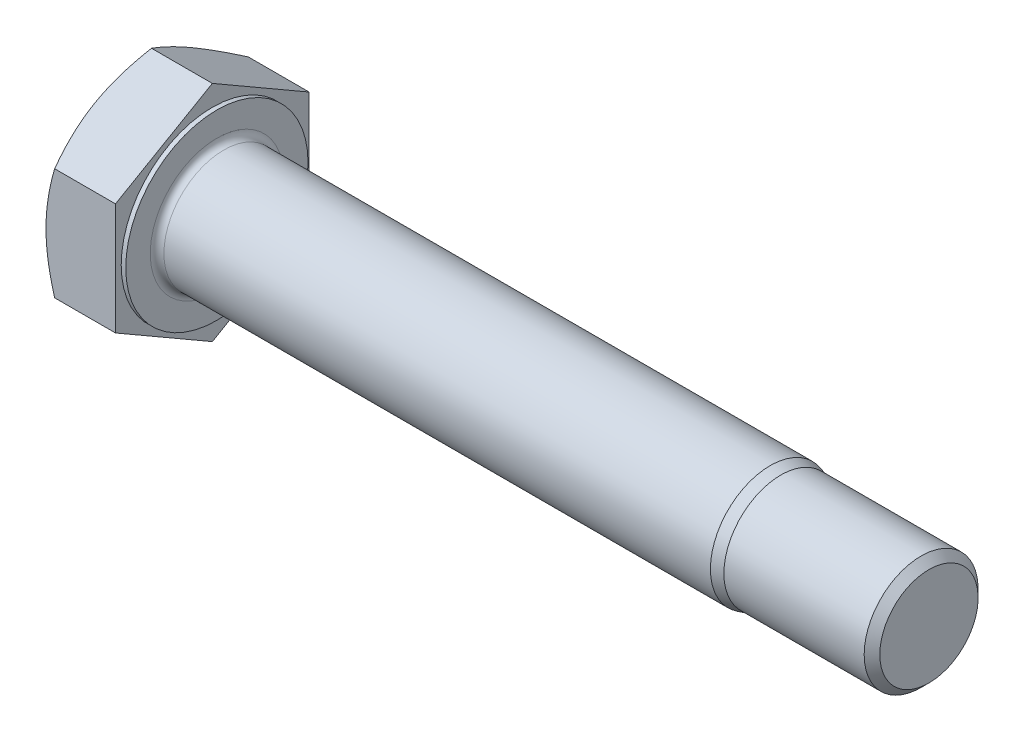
ISO-10303-21;
HEADER;
FILE_DESCRIPTION(('STEP AP214'),'2;1');
FILE_NAME('part.step','',(''),(''),'','','');
FILE_SCHEMA(('AUTOMOTIVE_DESIGN { 1 0 10303 214 1 1 1 1 }'));
ENDSEC;
DATA;
#1=APPLICATION_CONTEXT('core data for automotive mechanical design processes');
#2=APPLICATION_PROTOCOL_DEFINITION('international standard','automotive_design',2000,#1);
#3=PRODUCT_CONTEXT('',#1,'mechanical');
#4=PRODUCT('Part','Part','',(#3));
#5=PRODUCT_RELATED_PRODUCT_CATEGORY('part','',(#4));
#6=PRODUCT_DEFINITION_FORMATION('','',#4);
#7=PRODUCT_DEFINITION_CONTEXT('part definition',#1,'design');
#8=PRODUCT_DEFINITION('design','',#6,#7);
#9=PRODUCT_DEFINITION_SHAPE('','',#8);
#10=(LENGTH_UNIT() NAMED_UNIT(*) SI_UNIT(.MILLI.,.METRE.));
#11=(NAMED_UNIT(*) PLANE_ANGLE_UNIT() SI_UNIT($,.RADIAN.));
#12=(NAMED_UNIT(*) SI_UNIT($,.STERADIAN.) SOLID_ANGLE_UNIT());
#13=UNCERTAINTY_MEASURE_WITH_UNIT(LENGTH_MEASURE(1.E-05),#10,'distance_accuracy_value','');
#14=(GEOMETRIC_REPRESENTATION_CONTEXT(3) GLOBAL_UNCERTAINTY_ASSIGNED_CONTEXT((#13)) GLOBAL_UNIT_ASSIGNED_CONTEXT((#10,
#11,#12)) REPRESENTATION_CONTEXT('',''));
#15=CARTESIAN_POINT('',(0.,0.,0.));
#16=DIRECTION('',(0.,0.,1.));
#17=DIRECTION('',(1.,0.,0.));
#18=AXIS2_PLACEMENT_3D('',#15,#16,#17);
#19=CARTESIAN_POINT('',(13.,19.6299091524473,0.));
#20=DIRECTION('',(1.,0.,0.));
#21=DIRECTION('',(0.,0.,-1.));
#22=AXIS2_PLACEMENT_3D('',#19,#20,#21);
#23=PLANE('',#22);
#24=CARTESIAN_POINT('',(13.,0.,0.));
#25=DIRECTION('',(1.,0.,0.));
#26=DIRECTION('',(0.,0.,-1.));
#27=AXIS2_PLACEMENT_3D('',#24,#25,#26);
#28=CIRCLE('',#27,11.7);
#29=CARTESIAN_POINT('',(13.,0.,-11.7));
#30=VERTEX_POINT('',#29);
#31=EDGE_CURVE('E40',#30,#30,#28,.F.);
#32=ORIENTED_EDGE('',*,*,#31,.T.);
#33=EDGE_LOOP('',(#32));
#34=FACE_BOUND('',#33,.T.);
#35=CARTESIAN_POINT('',(13.,0.,0.));
#36=DIRECTION('',(-1.,0.,0.));
#37=DIRECTION('',(0.,0.,1.));
#38=AXIS2_PLACEMENT_3D('',#35,#36,#37);
#39=CIRCLE('',#38,16.);
#40=CARTESIAN_POINT('',(13.,0.,16.));
#41=VERTEX_POINT('',#40);
#42=EDGE_CURVE('E430',#41,#41,#39,.T.);
#43=ORIENTED_EDGE('',*,*,#42,.F.);
#44=EDGE_LOOP('',(#43));
#45=FACE_BOUND('',#44,.T.);
#46=ADVANCED_FACE('F32',(#34,#45),#23,.T.);
#47=CARTESIAN_POINT('',(138.,0.,0.));
#48=DIRECTION('',(-1.,0.,0.));
#49=DIRECTION('',(0.,0.,1.));
#50=AXIS2_PLACEMENT_3D('',#47,#48,#49);
#51=PLANE('',#50);
#52=CARTESIAN_POINT('',(138.,0.,0.));
#53=DIRECTION('',(-1.,0.,0.));
#54=DIRECTION('',(0.,0.,1.));
#55=AXIS2_PLACEMENT_3D('',#52,#53,#54);
#56=CIRCLE('',#55,8.626);
#57=CARTESIAN_POINT('',(138.,0.,8.626));
#58=VERTEX_POINT('',#57);
#59=EDGE_CURVE('E378',#58,#58,#56,.T.);
#60=ORIENTED_EDGE('',*,*,#59,.F.);
#61=EDGE_LOOP('',(#60));
#62=FACE_BOUND('',#61,.T.);
#63=ADVANCED_FACE('F155',(#62),#51,.F.);
#64=CARTESIAN_POINT('',(138.,0.,0.));
#65=DIRECTION('',(-1.,0.,0.));
#66=DIRECTION('',(0.,0.,1.));
#67=AXIS2_PLACEMENT_3D('',#64,#65,#66);
#68=CONICAL_SURFACE('',#67,8.626,0.785398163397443);
#69=CARTESIAN_POINT('',(136.626,0.,0.));
#70=DIRECTION('',(-1.,0.,0.));
#71=DIRECTION('',(0.,0.,1.));
#72=AXIS2_PLACEMENT_3D('',#69,#70,#71);
#73=CIRCLE('',#72,10.);
#74=CARTESIAN_POINT('',(136.626,0.,10.));
#75=VERTEX_POINT('',#74);
#76=EDGE_CURVE('E375',#75,#75,#73,.T.);
#77=ORIENTED_EDGE('',*,*,#76,.F.);
#78=EDGE_LOOP('',(#77));
#79=FACE_BOUND('',#78,.T.);
#80=ORIENTED_EDGE('',*,*,#59,.T.);
#81=EDGE_LOOP('',(#80));
#82=FACE_BOUND('',#81,.T.);
#83=ADVANCED_FACE('F160',(#79,#82),#68,.T.);
#84=CARTESIAN_POINT('',(0.,0.,0.));
#85=DIRECTION('',(-1.,0.,0.));
#86=DIRECTION('',(0.,0.,1.));
#87=AXIS2_PLACEMENT_3D('',#84,#85,#86);
#88=CYLINDRICAL_SURFACE('',#87,10.);
#89=CARTESIAN_POINT('',(112.,0.,0.));
#90=DIRECTION('',(-1.,0.,0.));
#91=DIRECTION('',(0.,0.,1.));
#92=AXIS2_PLACEMENT_3D('',#89,#90,#91);
#93=CIRCLE('',#92,10.);
#94=CARTESIAN_POINT('',(112.,0.,10.));
#95=VERTEX_POINT('',#94);
#96=EDGE_CURVE('E383',#95,#95,#93,.T.);
#97=ORIENTED_EDGE('',*,*,#96,.F.);
#98=EDGE_LOOP('',(#97));
#99=FACE_BOUND('',#98,.T.);
#100=ORIENTED_EDGE('',*,*,#76,.T.);
#101=EDGE_LOOP('',(#100));
#102=FACE_BOUND('',#101,.T.);
#103=ADVANCED_FACE('F345',(#99,#102),#88,.T.);
#104=CARTESIAN_POINT('',(112.,0.,0.));
#105=DIRECTION('',(-1.,0.,0.));
#106=DIRECTION('',(0.,0.,1.));
#107=AXIS2_PLACEMENT_3D('',#104,#105,#106);
#108=CONICAL_SURFACE('',#107,10.,0.261799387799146);
#109=CARTESIAN_POINT('',(110.133974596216,0.,0.));
#110=DIRECTION('',(-1.,0.,0.));
#111=DIRECTION('',(0.,0.,1.));
#112=AXIS2_PLACEMENT_3D('',#109,#110,#111);
#113=CIRCLE('',#112,10.5);
#114=CARTESIAN_POINT('',(110.133974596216,0.,10.5));
#115=VERTEX_POINT('',#114);
#116=EDGE_CURVE('E405',#115,#115,#113,.T.);
#117=ORIENTED_EDGE('',*,*,#116,.F.);
#118=EDGE_LOOP('',(#117));
#119=FACE_BOUND('',#118,.T.);
#120=ORIENTED_EDGE('',*,*,#96,.T.);
#121=EDGE_LOOP('',(#120));
#122=FACE_BOUND('',#121,.T.);
#123=ADVANCED_FACE('F262',(#119,#122),#108,.T.);
#124=CARTESIAN_POINT('',(0.,0.,0.));
#125=DIRECTION('',(-1.,0.,0.));
#126=DIRECTION('',(0.,0.,1.));
#127=AXIS2_PLACEMENT_3D('',#124,#125,#126);
#128=CYLINDRICAL_SURFACE('',#127,10.5);
#129=CARTESIAN_POINT('',(14.2,0.,0.));
#130=DIRECTION('',(1.,0.,0.));
#131=DIRECTION('',(0.,0.,-1.));
#132=AXIS2_PLACEMENT_3D('',#129,#130,#131);
#133=CIRCLE('',#132,10.5);
#134=CARTESIAN_POINT('',(14.2,0.,-10.5));
#135=VERTEX_POINT('',#134);
#136=EDGE_CURVE('E11',#135,#135,#133,.T.);
#137=ORIENTED_EDGE('',*,*,#136,.T.);
#138=EDGE_LOOP('',(#137));
#139=FACE_BOUND('',#138,.T.);
#140=ORIENTED_EDGE('',*,*,#116,.T.);
#141=EDGE_LOOP('',(#140));
#142=FACE_BOUND('',#141,.T.);
#143=ADVANCED_FACE('F201',(#139,#142),#128,.T.);
#144=CARTESIAN_POINT('',(12.2,16.,0.));
#145=DIRECTION('',(1.,0.,0.));
#146=DIRECTION('',(0.,0.,-1.));
#147=AXIS2_PLACEMENT_3D('',#144,#145,#146);
#148=PLANE('',#147);
#149=CARTESIAN_POINT('',(12.2,0.,0.));
#150=DIRECTION('',(-1.,0.,0.));
#151=DIRECTION('',(0.,0.,1.));
#152=AXIS2_PLACEMENT_3D('',#149,#150,#151);
#153=CIRCLE('',#152,16.);
#154=CARTESIAN_POINT('',(12.2,0.,16.));
#155=VERTEX_POINT('',#154);
#156=EDGE_CURVE('E425',#155,#155,#153,.T.);
#157=ORIENTED_EDGE('',*,*,#156,.T.);
#158=EDGE_LOOP('',(#157));
#159=FACE_BOUND('',#158,.T.);
#160=DIRECTION('',(0.,0.500000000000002,0.866025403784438));
#161=VECTOR('',#160,1.);
#162=CARTESIAN_POINT('',(12.2,9.81495457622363,-17.));
#163=LINE('',#162,#161);
#164=CARTESIAN_POINT('',(12.2,9.81495457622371,-17.));
#165=VERTEX_POINT('',#164);
#166=CARTESIAN_POINT('',(12.2,19.6299091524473,0.));
#167=VERTEX_POINT('',#166);
#168=EDGE_CURVE('E109',#165,#167,#163,.T.);
#169=ORIENTED_EDGE('',*,*,#168,.T.);
#170=DIRECTION('',(0.,-0.500000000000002,0.866025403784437));
#171=VECTOR('',#170,1.);
#172=CARTESIAN_POINT('',(12.2,19.6299091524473,0.));
#173=LINE('',#172,#171);
#174=CARTESIAN_POINT('',(12.2,9.81495457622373,17.));
#175=VERTEX_POINT('',#174);
#176=EDGE_CURVE('E103',#167,#175,#173,.T.);
#177=ORIENTED_EDGE('',*,*,#176,.T.);
#178=DIRECTION('',(0.,-1.,0.));
#179=VECTOR('',#178,1.);
#180=CARTESIAN_POINT('',(12.2,9.81495457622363,17.));
#181=LINE('',#180,#179);
#182=CARTESIAN_POINT('',(12.2,-9.81495457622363,17.0000000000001));
#183=VERTEX_POINT('',#182);
#184=EDGE_CURVE('E106',#175,#183,#181,.T.);
#185=ORIENTED_EDGE('',*,*,#184,.T.);
#186=DIRECTION('',(0.,-0.500000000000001,-0.866025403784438));
#187=VECTOR('',#186,1.);
#188=CARTESIAN_POINT('',(12.2,-19.6299091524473,0.));
#189=LINE('',#188,#187);
#190=CARTESIAN_POINT('',(12.2,-19.6299091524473,0.));
#191=VERTEX_POINT('',#190);
#192=EDGE_CURVE('E122',#183,#191,#189,.T.);
#193=ORIENTED_EDGE('',*,*,#192,.T.);
#194=DIRECTION('',(0.,0.5,-0.866025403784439));
#195=VECTOR('',#194,1.);
#196=CARTESIAN_POINT('',(12.2,-9.81495457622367,-17.));
#197=LINE('',#196,#195);
#198=CARTESIAN_POINT('',(12.2,-9.81495457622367,-17.));
#199=VERTEX_POINT('',#198);
#200=EDGE_CURVE('E47',#191,#199,#197,.T.);
#201=ORIENTED_EDGE('',*,*,#200,.T.);
#202=DIRECTION('',(0.,1.,0.));
#203=VECTOR('',#202,1.);
#204=CARTESIAN_POINT('',(12.2,9.81495457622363,-17.));
#205=LINE('',#204,#203);
#206=EDGE_CURVE('E140',#199,#165,#205,.T.);
#207=ORIENTED_EDGE('',*,*,#206,.T.);
#208=EDGE_LOOP('',(#169,#177,#185,#193,#201,#207));
#209=FACE_BOUND('',#208,.T.);
#210=ADVANCED_FACE('F105',(#159,#209),#148,.T.);
#211=CARTESIAN_POINT('',(0.,0.,0.));
#212=DIRECTION('',(-1.,0.,0.));
#213=DIRECTION('',(0.,0.,1.));
#214=AXIS2_PLACEMENT_3D('',#211,#212,#213);
#215=CYLINDRICAL_SURFACE('',#214,16.);
#216=ORIENTED_EDGE('',*,*,#42,.T.);
#217=EDGE_LOOP('',(#216));
#218=FACE_BOUND('',#217,.T.);
#219=ORIENTED_EDGE('',*,*,#156,.F.);
#220=EDGE_LOOP('',(#219));
#221=FACE_BOUND('',#220,.T.);
#222=ADVANCED_FACE('F169',(#218,#221),#215,.T.);
#223=CARTESIAN_POINT('',(0.,19.6299091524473,0.));
#224=DIRECTION('',(1.,0.,0.));
#225=DIRECTION('',(0.,0.,-1.));
#226=AXIS2_PLACEMENT_3D('',#223,#224,#225);
#227=PLANE('',#226);
#228=CARTESIAN_POINT('',(0.,0.,0.));
#229=DIRECTION('',(1.,0.,0.));
#230=DIRECTION('',(0.,0.,-1.));
#231=AXIS2_PLACEMENT_3D('',#228,#229,#230);
#232=CIRCLE('',#231,17.);
#233=CARTESIAN_POINT('',(0.,0.,-17.));
#234=VERTEX_POINT('',#233);
#235=CARTESIAN_POINT('',(0.,14.7224318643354,-8.50000000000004));
#236=VERTEX_POINT('',#235);
#237=EDGE_CURVE('E139',#234,#236,#232,.T.);
#238=ORIENTED_EDGE('',*,*,#237,.F.);
#239=CARTESIAN_POINT('',(0.,-14.7224318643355,-8.50000000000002));
#240=VERTEX_POINT('',#239);
#241=EDGE_CURVE('E130',#240,#234,#232,.T.);
#242=ORIENTED_EDGE('',*,*,#241,.F.);
#243=CARTESIAN_POINT('',(0.,-14.7224318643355,8.50000000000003));
#244=VERTEX_POINT('',#243);
#245=EDGE_CURVE('E138',#244,#240,#232,.T.);
#246=ORIENTED_EDGE('',*,*,#245,.F.);
#247=CARTESIAN_POINT('',(0.,0.,17.));
#248=VERTEX_POINT('',#247);
#249=EDGE_CURVE('E403',#248,#244,#232,.T.);
#250=ORIENTED_EDGE('',*,*,#249,.F.);
#251=CARTESIAN_POINT('',(0.,14.7224318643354,8.50000000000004));
#252=VERTEX_POINT('',#251);
#253=EDGE_CURVE('E416',#252,#248,#232,.T.);
#254=ORIENTED_EDGE('',*,*,#253,.F.);
#255=EDGE_CURVE('E415',#236,#252,#232,.T.);
#256=ORIENTED_EDGE('',*,*,#255,.F.);
#257=EDGE_LOOP('',(#238,#242,#246,#250,#254,#256));
#258=FACE_BOUND('',#257,.T.);
#259=ADVANCED_FACE('F165',(#258),#227,.F.);
#260=CARTESIAN_POINT('',(-4.25000000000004,0.,0.));
#261=DIRECTION('',(1.,0.,0.));
#262=DIRECTION('',(0.,0.,-1.));
#263=AXIS2_PLACEMENT_3D('',#260,#261,#262);
#264=CONICAL_SURFACE('',#263,9.63878406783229,1.04719755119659);
#265=CARTESIAN_POINT('',(1.51844542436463,19.6300246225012,0.000200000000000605));
#266=CARTESIAN_POINT('',(1.39390284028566,19.4142959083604,-0.373453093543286));
#267=CARTESIAN_POINT('',(1.27501178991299,19.197725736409,-0.748563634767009));
#268=CARTESIAN_POINT('',(1.05010368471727,18.7628487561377,-1.50179265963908));
#269=CARTESIAN_POINT('',(0.944090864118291,18.5445414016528,-1.87991208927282));
#270=CARTESIAN_POINT('',(0.74636424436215,18.1057681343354,-2.63988968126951));
#271=CARTESIAN_POINT('',(0.654684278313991,17.8852983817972,-3.02175449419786));
#272=CARTESIAN_POINT('',(0.48759203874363,17.4428269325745,-3.78813752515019));
#273=CARTESIAN_POINT('',(0.412178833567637,17.2208253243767,-4.17265558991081));
#274=CARTESIAN_POINT('',(0.280827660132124,16.7809786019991,-4.9344924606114));
#275=CARTESIAN_POINT('',(0.224454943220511,16.5631661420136,-5.31175470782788));
#276=CARTESIAN_POINT('',(0.12993050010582,16.1265431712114,-6.06800787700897));
#277=CARTESIAN_POINT('',(0.0917791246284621,15.9077326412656,-6.44699883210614));
#278=CARTESIAN_POINT('',(0.0346606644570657,15.4697440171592,-7.20561738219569));
#279=CARTESIAN_POINT('',(0.0156707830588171,15.2505666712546,-7.58524368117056));
#280=CARTESIAN_POINT('',(-0.00271629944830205,14.8120096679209,-8.34484669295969));
#281=CARTESIAN_POINT('',(-0.00211410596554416,14.5926300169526,-8.72482339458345));
#282=CARTESIAN_POINT('',(0.0173147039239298,14.1824942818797,-9.4351993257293));
#283=CARTESIAN_POINT('',(0.0337721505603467,13.9917089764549,-9.76564916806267));
#284=CARTESIAN_POINT('',(0.0811925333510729,13.6105934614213,-10.4257606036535));
#285=CARTESIAN_POINT('',(0.112155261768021,13.4202632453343,-10.7554222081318));
#286=CARTESIAN_POINT('',(0.188048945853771,13.0401300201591,-11.4138322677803));
#287=CARTESIAN_POINT('',(0.232992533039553,12.8503276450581,-11.7425796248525));
#288=CARTESIAN_POINT('',(0.336054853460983,12.4716264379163,-12.3985093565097));
#289=CARTESIAN_POINT('',(0.39417353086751,12.2827276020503,-12.7256917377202));
#290=CARTESIAN_POINT('',(0.589770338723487,11.709300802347,-13.718896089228));
#291=CARTESIAN_POINT('',(0.746752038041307,11.3264334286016,-14.3820418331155));
#292=CARTESIAN_POINT('',(1.10303610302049,10.5664076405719,-15.6984451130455));
#293=CARTESIAN_POINT('',(1.30225479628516,10.189239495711,-16.351719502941));
#294=CARTESIAN_POINT('',(1.5184454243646,9.81483910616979,-17.0002));
#295=B_SPLINE_CURVE_WITH_KNOTS('',3,(#265,#266,#267,#268,#269,#270,#271,#272,#273,#274,#275,
#276,#277,#278,#279,#280,#281,#282,#283,#284,#285,#286,#287,#288,#289,#290,#291,#292,#293,#294),
.UNSPECIFIED.,.F.,.F.,(4,2,2,2,2,2,2,2,2,2,2,2,2,2,4),(0.,1.34725361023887,2.69494899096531,
4.04577911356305,5.39653184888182,6.71394507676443,8.03138366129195,9.34725301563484,
10.6630817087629,11.8085815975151,12.9540650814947,14.1005865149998,15.2471030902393,
17.590639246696,19.9295754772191),.UNSPECIFIED.);
#296=CARTESIAN_POINT('',(1.51837875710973,19.6299091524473,0.));
#297=VERTEX_POINT('',#296);
#298=EDGE_CURVE('E55',#297,#236,#295,.T.);
#299=ORIENTED_EDGE('',*,*,#298,.T.);
#300=ORIENTED_EDGE('',*,*,#255,.T.);
#301=CARTESIAN_POINT('',(1.5184454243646,9.81483910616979,17.0002));
#302=CARTESIAN_POINT('',(1.39390284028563,10.0305678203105,16.6265469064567));
#303=CARTESIAN_POINT('',(1.27501178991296,10.2471379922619,16.251436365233));
#304=CARTESIAN_POINT('',(1.05010368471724,10.6820149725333,15.4982073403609));
#305=CARTESIAN_POINT('',(0.944090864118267,10.9003223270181,15.1200879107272));
#306=CARTESIAN_POINT('',(0.746364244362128,11.3390955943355,14.3601103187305));
#307=CARTESIAN_POINT('',(0.65468427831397,11.5595653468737,13.9782455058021));
#308=CARTESIAN_POINT('',(0.487592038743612,12.0020367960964,13.2118624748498));
#309=CARTESIAN_POINT('',(0.412178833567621,12.2240384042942,12.8273444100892));
#310=CARTESIAN_POINT('',(0.280827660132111,12.6638851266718,12.0655075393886));
#311=CARTESIAN_POINT('',(0.2244549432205,12.8816975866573,11.6882452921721));
#312=CARTESIAN_POINT('',(0.129930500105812,13.3183205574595,10.931992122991));
#313=CARTESIAN_POINT('',(0.0917791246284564,13.5371310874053,10.5530011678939));
#314=CARTESIAN_POINT('',(0.0346606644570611,13.9751197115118,9.79438261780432));
#315=CARTESIAN_POINT('',(0.0156707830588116,14.1942970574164,9.41475631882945));
#316=CARTESIAN_POINT('',(-0.00271629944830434,14.6328540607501,8.65515330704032));
#317=CARTESIAN_POINT('',(-0.00211410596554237,14.8522337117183,8.27517660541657));
#318=CARTESIAN_POINT('',(0.0173147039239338,15.2623694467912,7.56480067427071));
#319=CARTESIAN_POINT('',(0.0337721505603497,15.4531547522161,7.23435083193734));
#320=CARTESIAN_POINT('',(0.0811925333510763,15.8342702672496,6.57423939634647));
#321=CARTESIAN_POINT('',(0.112155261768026,16.0246004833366,6.24457779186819));
#322=CARTESIAN_POINT('',(0.188048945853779,16.4047337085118,5.58616773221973));
#323=CARTESIAN_POINT('',(0.232992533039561,16.5945360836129,5.25742037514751));
#324=CARTESIAN_POINT('',(0.336054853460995,16.9732372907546,4.60149064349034));
#325=CARTESIAN_POINT('',(0.394173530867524,17.1621361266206,4.27430826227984));
#326=CARTESIAN_POINT('',(0.589770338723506,17.735562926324,3.28110391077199));
#327=CARTESIAN_POINT('',(0.746752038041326,18.1184303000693,2.61795816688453));
#328=CARTESIAN_POINT('',(1.10303610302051,18.8784560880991,1.30155488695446));
#329=CARTESIAN_POINT('',(1.30225479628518,19.2556242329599,0.648280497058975));
#330=CARTESIAN_POINT('',(1.51844542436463,19.6300246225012,-0.000200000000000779));
#331=B_SPLINE_CURVE_WITH_KNOTS('',3,(#301,#302,#303,#304,#305,#306,#307,#308,#309,#310,#311,
#312,#313,#314,#315,#316,#317,#318,#319,#320,#321,#322,#323,#324,#325,#326,#327,#328,#329,#330),
.UNSPECIFIED.,.F.,.F.,(4,2,2,2,2,2,2,2,2,2,2,2,2,2,4),(0.,1.34725361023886,2.69494899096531,
4.04577911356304,5.39653184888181,6.71394507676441,8.03138366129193,9.34725301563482,
10.6630817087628,11.808581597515,12.9540650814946,14.1005865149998,15.2471030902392,
17.590639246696,19.9295754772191),.UNSPECIFIED.);
#332=EDGE_CURVE('E404',#252,#297,#331,.T.);
#333=ORIENTED_EDGE('',*,*,#332,.T.);
#334=EDGE_LOOP('',(#299,#300,#333));
#335=FACE_BOUND('',#334,.T.);
#336=ADVANCED_FACE('F168',(#335),#264,.T.);
#337=CARTESIAN_POINT('',(1.5183787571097,9.81495457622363,17.));
#338=VERTEX_POINT('',#337);
#339=EDGE_CURVE('E127',#338,#252,#331,.T.);
#340=ORIENTED_EDGE('',*,*,#339,.T.);
#341=ORIENTED_EDGE('',*,*,#253,.T.);
#342=CARTESIAN_POINT('',(8.31942681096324,-26.4115006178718,17.));
#343=CARTESIAN_POINT('',(8.13911017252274,-26.0400720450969,17.));
#344=CARTESIAN_POINT('',(7.95968911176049,-25.6682089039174,17.));
#345=CARTESIAN_POINT('',(7.60284087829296,-24.9235228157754,17.));
#346=CARTESIAN_POINT('',(7.42541372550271,-24.5506998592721,17.));
#347=CARTESIAN_POINT('',(6.8963807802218,-23.4305566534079,17.));
#348=CARTESIAN_POINT('',(6.54807662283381,-22.6816711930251,17.));
#349=CARTESIAN_POINT('',(5.86050460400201,-21.1748517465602,17.));
#350=CARTESIAN_POINT('',(5.52129585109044,-20.4168907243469,17.));
#351=CARTESIAN_POINT('',(4.85669075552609,-18.8949576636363,17.));
#352=CARTESIAN_POINT('',(4.53129376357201,-18.1309859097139,17.));
#353=CARTESIAN_POINT('',(3.88770296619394,-16.570940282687,17.));
#354=CARTESIAN_POINT('',(3.57008382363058,-15.7746280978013,17.));
#355=CARTESIAN_POINT('',(2.95876852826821,-14.1726991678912,17.));
#356=CARTESIAN_POINT('',(2.66507505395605,-13.3670813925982,17.));
#357=CARTESIAN_POINT('',(2.10929110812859,-11.7467785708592,17.));
#358=CARTESIAN_POINT('',(1.84713706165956,-10.9321155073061,17.));
#359=CARTESIAN_POINT('',(1.36279802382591,-9.29102605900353,17.));
#360=CARTESIAN_POINT('',(1.1406004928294,-8.46460345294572,17.));
#361=CARTESIAN_POINT('',(0.84589902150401,-7.2182986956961,17.));
#362=CARTESIAN_POINT('',(0.754297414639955,-6.80290529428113,17.));
#363=CARTESIAN_POINT('',(0.585044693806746,-5.96927131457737,17.));
#364=CARTESIAN_POINT('',(0.507393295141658,-5.55103079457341,17.));
#365=CARTESIAN_POINT('',(0.367410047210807,-4.71199525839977,17.));
#366=CARTESIAN_POINT('',(0.305077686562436,-4.29120032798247,17.));
#367=CARTESIAN_POINT('',(0.196970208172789,-3.44747421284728,17.));
#368=CARTESIAN_POINT('',(0.151195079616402,-3.02454302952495,17.));
#369=CARTESIAN_POINT('',(0.0776920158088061,-2.18270155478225,17.));
#370=CARTESIAN_POINT('',(0.0497349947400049,-1.76381138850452,17.));
#371=CARTESIAN_POINT('',(0.0115629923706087,-0.92522484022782,17.));
#372=CARTESIAN_POINT('',(0.00134771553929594,-0.505528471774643,17.));
#373=CARTESIAN_POINT('',(-0.00109768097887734,0.333921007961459,17.));
#374=CARTESIAN_POINT('',(0.00667227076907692,0.753674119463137,17.));
#375=CARTESIAN_POINT('',(0.0400072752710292,1.5924777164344,17.));
#376=CARTESIAN_POINT('',(0.0655731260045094,2.01152816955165,17.));
#377=CARTESIAN_POINT('',(0.147740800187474,3.01721815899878,17.));
#378=CARTESIAN_POINT('',(0.21270728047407,3.60318639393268,17.));
#379=CARTESIAN_POINT('',(0.373909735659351,4.77080853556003,17.));
#380=CARTESIAN_POINT('',(0.470149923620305,5.35246185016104,17.));
#381=CARTESIAN_POINT('',(0.690476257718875,6.51088838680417,17.));
#382=CARTESIAN_POINT('',(0.814584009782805,7.08765746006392,17.));
#383=CARTESIAN_POINT('',(1.08685534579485,8.23542661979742,17.));
#384=CARTESIAN_POINT('',(1.23501857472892,8.80642679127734,17.));
#385=CARTESIAN_POINT('',(1.55529451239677,9.95521544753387,17.));
#386=CARTESIAN_POINT('',(1.72786338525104,10.5328758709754,17.));
#387=CARTESIAN_POINT('',(2.09091775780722,11.6825068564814,17.));
#388=CARTESIAN_POINT('',(2.28140337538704,12.2544773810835,17.));
#389=CARTESIAN_POINT('',(2.67725920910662,13.3930094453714,17.));
#390=CARTESIAN_POINT('',(2.88262452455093,13.9595726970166,17.));
#391=CARTESIAN_POINT('',(3.30581525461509,15.0879990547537,17.));
#392=CARTESIAN_POINT('',(3.52364052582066,15.6498622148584,17.));
#393=CARTESIAN_POINT('',(4.05008547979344,16.9712175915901,17.));
#394=CARTESIAN_POINT('',(4.36313070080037,17.7289439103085,17.));
#395=CARTESIAN_POINT('',(5.00438946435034,19.2379699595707,17.));
#396=CARTESIAN_POINT('',(5.33260393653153,19.9892692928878,17.));
#397=CARTESIAN_POINT('',(6.00117712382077,21.4866313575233,17.));
#398=CARTESIAN_POINT('',(6.34153852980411,22.232692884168,17.));
#399=CARTESIAN_POINT('',(7.03196558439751,23.7202815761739,17.));
#400=CARTESIAN_POINT('',(7.38203102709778,24.4618088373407,17.));
#401=CARTESIAN_POINT('',(8.09044527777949,25.9418854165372,17.));
#402=CARTESIAN_POINT('',(8.44880271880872,26.6804305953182,17.));
#403=CARTESIAN_POINT('',(9.17201951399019,28.1543299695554,17.));
#404=CARTESIAN_POINT('',(9.53687889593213,28.8896841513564,17.));
#405=CARTESIAN_POINT('',(10.2719425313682,30.3575977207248,17.));
#406=CARTESIAN_POINT('',(10.6421461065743,31.0901574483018,17.));
#407=CARTESIAN_POINT('',(11.3870695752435,32.5529729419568,17.));
#408=CARTESIAN_POINT('',(11.761789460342,33.2832287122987,17.));
#409=CARTESIAN_POINT('',(12.8287339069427,35.3492330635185,17.));
#410=CARTESIAN_POINT('',(13.525439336,36.6826675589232,17.));
#411=CARTESIAN_POINT('',(14.9283929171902,39.3445549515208,17.));
#412=CARTESIAN_POINT('',(15.6346414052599,40.67300767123,17.));
#413=CARTESIAN_POINT('',(17.0526808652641,43.3226952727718,17.));
#414=CARTESIAN_POINT('',(17.7644536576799,44.6439398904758,17.));
#415=CARTESIAN_POINT('',(18.8363653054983,46.6234545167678,17.));
#416=CARTESIAN_POINT('',(19.1943681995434,47.28288288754,17.));
#417=CARTESIAN_POINT('',(19.9116498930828,48.6010440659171,17.));
#418=CARTESIAN_POINT('',(20.2709286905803,49.2597768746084,17.));
#419=CARTESIAN_POINT('',(20.6307720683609,49.9182012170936,17.));
#420=B_SPLINE_CURVE_WITH_KNOTS('',3,(#342,#343,#344,#345,#346,#347,#348,#349,#350,#351,#352,
#353,#354,#355,#356,#357,#358,#359,#360,#361,#362,#363,#364,#365,#366,#367,#368,#369,#370,#371,
#372,#373,#374,#375,#376,#377,#378,#379,#380,#381,#382,#383,#384,#385,#386,#387,#388,#389,#390,
#391,#392,#393,#394,#395,#396,#397,#398,#399,#400,#401,#402,#403,#404,#405,#406,#407,#408,#409,
#410,#411,#412,#413,#414,#415,#416,#417,#418,#419),.UNSPECIFIED.,.F.,.F.,(4,2,2,2,2,2,2,2,2,2,2,
2,2,2,2,2,2,2,2,2,2,2,2,2,2,2,2,2,2,2,2,2,2,2,2,2,2,2,4),(0.,1.23865005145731,2.47731246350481,
4.95500137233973,7.44609998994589,9.93708136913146,12.5087433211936,15.0806927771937,
17.6473677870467,20.2132358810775,21.4891597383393,22.7650575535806,24.0409127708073,
25.3167671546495,26.5758682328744,27.8349483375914,29.0940334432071,30.3531750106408,
32.1208739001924,33.8888110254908,35.6581236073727,37.4274100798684,39.2357210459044,
41.044043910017,42.8517738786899,44.6594830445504,47.1187955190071,49.5782589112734,
52.0382705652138,54.4982300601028,56.9608774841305,59.4235354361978,61.8858835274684,
64.3482270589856,68.8615945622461,73.3751213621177,77.8774095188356,80.1284319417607,
82.3794508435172),.UNSPECIFIED.);
#421=EDGE_CURVE('E224',#248,#338,#420,.T.);
#422=ORIENTED_EDGE('',*,*,#421,.T.);
#423=EDGE_LOOP('',(#340,#341,#422));
#424=FACE_BOUND('',#423,.T.);
#425=ADVANCED_FACE('F199',(#424),#264,.T.);
#426=CARTESIAN_POINT('',(1.51837875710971,-9.81495457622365,17.));
#427=VERTEX_POINT('',#426);
#428=EDGE_CURVE('E219',#427,#248,#420,.T.);
#429=ORIENTED_EDGE('',*,*,#428,.T.);
#430=ORIENTED_EDGE('',*,*,#249,.T.);
#431=CARTESIAN_POINT('',(1.51844542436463,-19.6300246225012,-0.000200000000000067));
#432=CARTESIAN_POINT('',(1.39390284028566,-19.4142959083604,0.373453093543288));
#433=CARTESIAN_POINT('',(1.27501178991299,-19.197725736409,0.748563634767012));
#434=CARTESIAN_POINT('',(1.05010368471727,-18.7628487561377,1.50179265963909));
#435=CARTESIAN_POINT('',(0.944090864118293,-18.5445414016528,1.87991208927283));
#436=CARTESIAN_POINT('',(0.746364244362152,-18.1057681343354,2.63988968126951));
#437=CARTESIAN_POINT('',(0.654684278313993,-17.8852983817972,3.02175449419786));
#438=CARTESIAN_POINT('',(0.487592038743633,-17.4428269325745,3.78813752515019));
#439=CARTESIAN_POINT('',(0.412178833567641,-17.2208253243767,4.17265558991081));
#440=CARTESIAN_POINT('',(0.280827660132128,-16.7809786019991,4.93449246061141));
#441=CARTESIAN_POINT('',(0.224454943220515,-16.5631661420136,5.31175470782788));
#442=CARTESIAN_POINT('',(0.129930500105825,-16.1265431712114,6.06800787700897));
#443=CARTESIAN_POINT('',(0.0917791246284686,-15.9077326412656,6.44699883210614));
#444=CARTESIAN_POINT('',(0.0346606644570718,-15.4697440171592,7.20561738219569));
#445=CARTESIAN_POINT('',(0.0156707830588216,-15.2505666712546,7.58524368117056));
#446=CARTESIAN_POINT('',(-0.0027162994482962,-14.8120096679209,8.34484669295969));
#447=CARTESIAN_POINT('',(-0.00211410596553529,-14.5926300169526,8.72482339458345));
#448=CARTESIAN_POINT('',(0.0173147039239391,-14.1824942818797,9.43519932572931));
#449=CARTESIAN_POINT('',(0.0337721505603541,-13.9917089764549,9.76564916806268));
#450=CARTESIAN_POINT('',(0.0811925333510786,-13.6105934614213,10.4257606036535));
#451=CARTESIAN_POINT('',(0.112155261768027,-13.4202632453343,10.7554222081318));
#452=CARTESIAN_POINT('',(0.188048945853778,-13.0401300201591,11.4138322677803));
#453=CARTESIAN_POINT('',(0.23299253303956,-12.8503276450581,11.7425796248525));
#454=CARTESIAN_POINT('',(0.336054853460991,-12.4716264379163,12.3985093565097));
#455=CARTESIAN_POINT('',(0.394173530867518,-12.2827276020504,12.7256917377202));
#456=CARTESIAN_POINT('',(0.589770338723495,-11.709300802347,13.718896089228));
#457=CARTESIAN_POINT('',(0.746752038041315,-11.3264334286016,14.3820418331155));
#458=CARTESIAN_POINT('',(1.1030361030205,-10.5664076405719,15.6984451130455));
#459=CARTESIAN_POINT('',(1.30225479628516,-10.189239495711,16.351719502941));
#460=CARTESIAN_POINT('',(1.51844542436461,-9.81483910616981,17.0002));
#461=B_SPLINE_CURVE_WITH_KNOTS('',3,(#431,#432,#433,#434,#435,#436,#437,#438,#439,#440,#441,
#442,#443,#444,#445,#446,#447,#448,#449,#450,#451,#452,#453,#454,#455,#456,#457,#458,#459,#460),
.UNSPECIFIED.,.F.,.F.,(4,2,2,2,2,2,2,2,2,2,2,2,2,2,4),(0.,1.34725361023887,2.69494899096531,
4.04577911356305,5.39653184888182,6.71394507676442,8.03138366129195,9.34725301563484,
10.6630817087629,11.8085815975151,12.9540650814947,14.1005865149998,15.2471030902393,
17.590639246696,19.9295754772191),.UNSPECIFIED.);
#462=EDGE_CURVE('E225',#244,#427,#461,.T.);
#463=ORIENTED_EDGE('',*,*,#462,.T.);
#464=EDGE_LOOP('',(#429,#430,#463));
#465=FACE_BOUND('',#464,.T.);
#466=ADVANCED_FACE('F317',(#465),#264,.T.);
#467=CARTESIAN_POINT('',(1.51837875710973,-19.6299091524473,0.));
#468=VERTEX_POINT('',#467);
#469=EDGE_CURVE('E214',#468,#244,#461,.T.);
#470=ORIENTED_EDGE('',*,*,#469,.T.);
#471=ORIENTED_EDGE('',*,*,#245,.T.);
#472=CARTESIAN_POINT('',(1.51844542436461,-9.81483910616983,-17.0002));
#473=CARTESIAN_POINT('',(1.39390284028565,-10.0305678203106,-16.6265469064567));
#474=CARTESIAN_POINT('',(1.27501178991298,-10.247137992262,-16.251436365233));
#475=CARTESIAN_POINT('',(1.05010368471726,-10.6820149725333,-15.4982073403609));
#476=CARTESIAN_POINT('',(0.944090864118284,-10.9003223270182,-15.1200879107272));
#477=CARTESIAN_POINT('',(0.746364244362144,-11.3390955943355,-14.3601103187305));
#478=CARTESIAN_POINT('',(0.654684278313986,-11.5595653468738,-13.9782455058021));
#479=CARTESIAN_POINT('',(0.487592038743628,-12.0020367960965,-13.2118624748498));
#480=CARTESIAN_POINT('',(0.412178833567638,-12.2240384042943,-12.8273444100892));
#481=CARTESIAN_POINT('',(0.280827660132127,-12.6638851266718,-12.0655075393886));
#482=CARTESIAN_POINT('',(0.224454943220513,-12.8816975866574,-11.6882452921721));
#483=CARTESIAN_POINT('',(0.129930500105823,-13.3183205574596,-10.931992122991));
#484=CARTESIAN_POINT('',(0.0917791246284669,-13.5371310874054,-10.5530011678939));
#485=CARTESIAN_POINT('',(0.0346606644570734,-13.9751197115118,-9.79438261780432));
#486=CARTESIAN_POINT('',(0.0156707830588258,-14.1942970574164,-9.41475631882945));
#487=CARTESIAN_POINT('',(-0.00271629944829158,-14.6328540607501,-8.65515330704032));
#488=CARTESIAN_POINT('',(-0.0021141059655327,-14.8522337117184,-8.27517660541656));
#489=CARTESIAN_POINT('',(0.0173147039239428,-15.2623694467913,-7.5648006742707));
#490=CARTESIAN_POINT('',(0.0337721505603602,-15.4531547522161,-7.23435083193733));
#491=CARTESIAN_POINT('',(0.0811925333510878,-15.8342702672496,-6.57423939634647));
#492=CARTESIAN_POINT('',(0.112155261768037,-16.0246004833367,-6.24457779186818));
#493=CARTESIAN_POINT('',(0.188048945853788,-16.4047337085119,-5.58616773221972));
#494=CARTESIAN_POINT('',(0.23299253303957,-16.5945360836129,-5.2574203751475));
#495=CARTESIAN_POINT('',(0.336054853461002,-16.9732372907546,-4.60149064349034));
#496=CARTESIAN_POINT('',(0.39417353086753,-17.1621361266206,-4.27430826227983));
#497=CARTESIAN_POINT('',(0.58977033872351,-17.735562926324,-3.28110391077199));
#498=CARTESIAN_POINT('',(0.746752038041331,-18.1184303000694,-2.61795816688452));
#499=CARTESIAN_POINT('',(1.10303610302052,-18.8784560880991,-1.30155488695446));
#500=CARTESIAN_POINT('',(1.30225479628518,-19.2556242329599,-0.648280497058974));
#501=CARTESIAN_POINT('',(1.51844542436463,-19.6300246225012,0.000200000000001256));
#502=B_SPLINE_CURVE_WITH_KNOTS('',3,(#472,#473,#474,#475,#476,#477,#478,#479,#480,#481,#482,
#483,#484,#485,#486,#487,#488,#489,#490,#491,#492,#493,#494,#495,#496,#497,#498,#499,#500,#501),
.UNSPECIFIED.,.F.,.F.,(4,2,2,2,2,2,2,2,2,2,2,2,2,2,4),(0.,1.34725361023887,2.69494899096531,
4.04577911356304,5.39653184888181,6.71394507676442,8.03138366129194,9.34725301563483,
10.6630817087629,11.8085815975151,12.9540650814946,14.1005865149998,15.2471030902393,
17.590639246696,19.9295754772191),.UNSPECIFIED.);
#503=EDGE_CURVE('E392',#240,#468,#502,.T.);
#504=ORIENTED_EDGE('',*,*,#503,.T.);
#505=EDGE_LOOP('',(#470,#471,#504));
#506=FACE_BOUND('',#505,.T.);
#507=ADVANCED_FACE('F300',(#506),#264,.T.);
#508=CARTESIAN_POINT('',(8.31942681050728,-26.4115006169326,-17.));
#509=CARTESIAN_POINT('',(8.13911017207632,-26.0400720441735,-17.));
#510=CARTESIAN_POINT('',(7.95968911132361,-25.6682089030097,-17.));
#511=CARTESIAN_POINT('',(7.60284087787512,-24.9235228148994,-17.));
#512=CARTESIAN_POINT('',(7.42541372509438,-24.5506998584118,-17.));
#513=CARTESIAN_POINT('',(6.89638077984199,-23.430556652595,-17.));
#514=CARTESIAN_POINT('',(6.54807662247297,-22.6816711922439,-17.));
#515=CARTESIAN_POINT('',(5.86050460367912,-21.1748517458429,-17.));
#516=CARTESIAN_POINT('',(5.52129585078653,-20.4168907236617,-17.));
#517=CARTESIAN_POINT('',(4.85669075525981,-18.8949576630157,-17.));
#518=CARTESIAN_POINT('',(4.5312937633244,-18.1309859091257,-17.));
#519=CARTESIAN_POINT('',(3.88770296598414,-16.570940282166,-17.));
#520=CARTESIAN_POINT('',(3.57008382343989,-15.7746280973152,-17.));
#521=CARTESIAN_POINT('',(2.9587685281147,-14.1726991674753,-17.));
#522=CARTESIAN_POINT('',(2.66507505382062,-13.3670813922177,-17.));
#523=CARTESIAN_POINT('',(2.10929110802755,-11.7467785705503,-17.));
#524=CARTESIAN_POINT('',(1.84713706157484,-10.9321155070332,-17.));
#525=CARTESIAN_POINT('',(1.36279802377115,-9.29102605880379,-17.));
#526=CARTESIAN_POINT('',(1.14060049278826,-8.46460345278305,-17.));
#527=CARTESIAN_POINT('',(0.845899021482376,-7.21829869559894,-17.));
#528=CARTESIAN_POINT('',(0.754297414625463,-6.80290529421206,-17.));
#529=CARTESIAN_POINT('',(0.585044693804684,-5.96927131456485,-17.));
#530=CARTESIAN_POINT('',(0.507393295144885,-5.55103079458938,-17.));
#531=CARTESIAN_POINT('',(0.367410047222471,-4.711995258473,-17.));
#532=CARTESIAN_POINT('',(0.30507768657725,-4.29120032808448,-17.));
#533=CARTESIAN_POINT('',(0.196970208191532,-3.44747421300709,-17.));
#534=CARTESIAN_POINT('',(0.151195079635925,-3.02454302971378,-17.));
#535=CARTESIAN_POINT('',(0.0776920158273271,-2.18270155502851,-17.));
#536=CARTESIAN_POINT('',(0.0497349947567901,-1.76381138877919,-17.));
#537=CARTESIAN_POINT('',(0.0115629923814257,-0.925224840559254,-17.));
#538=CARTESIAN_POINT('',(0.00134771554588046,-0.505528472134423,-17.));
#539=CARTESIAN_POINT('',(-0.00109768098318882,0.333921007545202,-17.));
#540=CARTESIAN_POINT('',(0.00667227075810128,0.753674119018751,-17.));
#541=CARTESIAN_POINT('',(0.0400072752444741,1.59247771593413,-17.));
#542=CARTESIAN_POINT('',(0.065573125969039,2.01152816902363,-17.));
#543=CARTESIAN_POINT('',(0.147740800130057,3.01721815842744,-17.));
#544=CARTESIAN_POINT('',(0.21270728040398,3.60318639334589,-17.));
#545=CARTESIAN_POINT('',(0.373909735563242,4.77080853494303,-17.));
#546=CARTESIAN_POINT('',(0.470149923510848,5.35246184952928,-17.));
#547=CARTESIAN_POINT('',(0.690476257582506,6.51088838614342,-17.));
#548=CARTESIAN_POINT('',(0.81458400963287,7.08765745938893,-17.));
#549=CARTESIAN_POINT('',(1.08685534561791,8.23542661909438,-17.));
#550=CARTESIAN_POINT('',(1.23501857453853,8.80642679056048,-17.));
#551=CARTESIAN_POINT('',(1.55529451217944,9.95521544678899,-17.));
#552=CARTESIAN_POINT('',(1.72786338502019,10.5328758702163,-17.));
#553=CARTESIAN_POINT('',(2.09091775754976,11.6825068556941,-17.));
#554=CARTESIAN_POINT('',(2.28140337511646,12.2544773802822,-17.));
#555=CARTESIAN_POINT('',(2.67725920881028,13.3930094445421,-17.));
#556=CARTESIAN_POINT('',(2.88262452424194,13.9595726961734,-17.));
#557=CARTESIAN_POINT('',(3.30581525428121,15.0879990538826,-17.));
#558=CARTESIAN_POINT('',(3.52364052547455,15.6498622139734,-17.));
#559=CARTESIAN_POINT('',(4.05008547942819,16.9712175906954,-17.));
#560=CARTESIAN_POINT('',(4.36313070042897,17.7289439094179,-17.));
#561=CARTESIAN_POINT('',(5.00438946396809,19.2379699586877,-17.));
#562=CARTESIAN_POINT('',(5.33260393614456,19.9892692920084,-17.));
#563=CARTESIAN_POINT('',(6.00117712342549,21.4866313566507,-17.));
#564=CARTESIAN_POINT('',(6.34153852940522,22.2326928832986,-17.));
#565=CARTESIAN_POINT('',(7.03196558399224,23.7202815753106,-17.));
#566=CARTESIAN_POINT('',(7.38203102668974,24.4618088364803,-17.));
#567=CARTESIAN_POINT('',(8.09044527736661,25.9418854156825,-17.));
#568=CARTESIAN_POINT('',(8.44880271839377,26.6804305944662,-17.));
#569=CARTESIAN_POINT('',(9.1720195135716,28.1543299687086,-17.));
#570=CARTESIAN_POINT('',(9.53687889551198,28.8896841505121,-17.));
#571=CARTESIAN_POINT('',(10.2719425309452,30.3575977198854,-17.));
#572=CARTESIAN_POINT('',(10.6421461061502,31.0901574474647,-17.));
#573=CARTESIAN_POINT('',(11.3870695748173,32.5529729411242,-17.));
#574=CARTESIAN_POINT('',(11.761789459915,33.2832287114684,-17.));
#575=CARTESIAN_POINT('',(12.828733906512,35.3492330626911,-17.));
#576=CARTESIAN_POINT('',(13.5254393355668,36.6826675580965,-17.));
#577=CARTESIAN_POINT('',(14.9283929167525,39.3445549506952,-17.));
#578=CARTESIAN_POINT('',(15.6346414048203,40.6730076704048,-17.));
#579=CARTESIAN_POINT('',(17.0526808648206,43.3226952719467,-17.));
#580=CARTESIAN_POINT('',(17.7644536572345,44.6439398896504,-17.));
#581=CARTESIAN_POINT('',(18.8363653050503,46.6234545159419,-17.));
#582=CARTESIAN_POINT('',(19.1943681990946,47.2828828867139,-17.));
#583=CARTESIAN_POINT('',(19.9116498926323,48.6010440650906,-17.));
#584=CARTESIAN_POINT('',(20.2709286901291,49.2597768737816,-17.));
#585=CARTESIAN_POINT('',(20.6307720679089,49.9182012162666,-17.));
#586=B_SPLINE_CURVE_WITH_KNOTS('',3,(#508,#509,#510,#511,#512,#513,#514,#515,#516,#517,#518,
#519,#520,#521,#522,#523,#524,#525,#526,#527,#528,#529,#530,#531,#532,#533,#534,#535,#536,#537,
#538,#539,#540,#541,#542,#543,#544,#545,#546,#547,#548,#549,#550,#551,#552,#553,#554,#555,#556,
#557,#558,#559,#560,#561,#562,#563,#564,#565,#566,#567,#568,#569,#570,#571,#572,#573,#574,#575,
#576,#577,#578,#579,#580,#581,#582,#583,#584,#585),.UNSPECIFIED.,.F.,.F.,(4,2,2,2,2,2,2,2,2,2,2,
2,2,2,2,2,2,2,2,2,2,2,2,2,2,2,2,2,2,2,2,2,2,2,2,2,2,2,4),(0.,1.23865005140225,2.47731246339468,
4.95500137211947,7.44609998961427,9.9370813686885,12.5087433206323,15.0806927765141,
17.6473677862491,20.213235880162,21.489159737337,22.7650575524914,24.0409127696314,
25.3167671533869,26.5758682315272,27.8349483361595,29.0940334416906,30.3531750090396,
32.120873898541,33.8888110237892,35.6581236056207,37.4274100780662,39.2357210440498,
41.04404390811,42.8517738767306,44.6594830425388,47.1187955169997,49.5782589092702,
52.0382705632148,54.4982300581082,56.9608774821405,59.4235354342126,61.8858835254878,
64.3482270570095,68.8615945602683,73.3751213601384,77.8774095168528,80.128431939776,
82.3794508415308),.UNSPECIFIED.);
#587=CARTESIAN_POINT('',(1.51837875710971,9.81495457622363,-17.));
#588=VERTEX_POINT('',#587);
#589=EDGE_CURVE('E190',#588,#234,#586,.F.);
#590=ORIENTED_EDGE('',*,*,#589,.T.);
#591=ORIENTED_EDGE('',*,*,#237,.T.);
#592=EDGE_CURVE('E209',#236,#588,#295,.T.);
#593=ORIENTED_EDGE('',*,*,#592,.T.);
#594=EDGE_LOOP('',(#590,#591,#593));
#595=FACE_BOUND('',#594,.T.);
#596=ADVANCED_FACE('F296',(#595),#264,.T.);
#597=CARTESIAN_POINT('',(1.51837875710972,-9.81495457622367,-17.));
#598=VERTEX_POINT('',#597);
#599=EDGE_CURVE('E189',#598,#240,#502,.T.);
#600=ORIENTED_EDGE('',*,*,#599,.T.);
#601=ORIENTED_EDGE('',*,*,#241,.T.);
#602=EDGE_CURVE('E181',#234,#598,#586,.F.);
#603=ORIENTED_EDGE('',*,*,#602,.T.);
#604=EDGE_LOOP('',(#600,#601,#603));
#605=FACE_BOUND('',#604,.T.);
#606=ADVANCED_FACE('F176',(#605),#264,.T.);
#607=CARTESIAN_POINT('',(13.,9.81495457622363,-17.));
#608=DIRECTION('',(0.,0.,1.));
#609=DIRECTION('',(1.,0.,0.));
#610=AXIS2_PLACEMENT_3D('',#607,#608,#609);
#611=PLANE('',#610);
#612=ORIENTED_EDGE('',*,*,#206,.F.);
#613=DIRECTION('',(-1.,0.,0.));
#614=VECTOR('',#613,1.);
#615=CARTESIAN_POINT('',(13.,-9.81495457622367,-17.));
#616=LINE('',#615,#614);
#617=EDGE_CURVE('E381',#199,#598,#616,.T.);
#618=ORIENTED_EDGE('',*,*,#617,.T.);
#619=ORIENTED_EDGE('',*,*,#602,.F.);
#620=ORIENTED_EDGE('',*,*,#589,.F.);
#621=DIRECTION('',(-1.,0.,0.));
#622=VECTOR('',#621,1.);
#623=CARTESIAN_POINT('',(13.,9.81495457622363,-17.));
#624=LINE('',#623,#622);
#625=EDGE_CURVE('E379',#165,#588,#624,.T.);
#626=ORIENTED_EDGE('',*,*,#625,.F.);
#627=EDGE_LOOP('',(#612,#618,#619,#620,#626));
#628=FACE_BOUND('',#627,.T.);
#629=ADVANCED_FACE('F171',(#628),#611,.F.);
#630=CARTESIAN_POINT('',(13.,-9.81495457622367,-17.));
#631=DIRECTION('',(0.,0.866025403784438,0.5));
#632=DIRECTION('',(0.,-0.5,0.866025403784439));
#633=AXIS2_PLACEMENT_3D('',#630,#631,#632);
#634=PLANE('',#633);
#635=ORIENTED_EDGE('',*,*,#200,.F.);
#636=DIRECTION('',(-1.,0.,0.));
#637=VECTOR('',#636,1.);
#638=CARTESIAN_POINT('',(13.,-19.6299091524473,0.));
#639=LINE('',#638,#637);
#640=EDGE_CURVE('E132',#191,#468,#639,.T.);
#641=ORIENTED_EDGE('',*,*,#640,.T.);
#642=ORIENTED_EDGE('',*,*,#503,.F.);
#643=ORIENTED_EDGE('',*,*,#599,.F.);
#644=ORIENTED_EDGE('',*,*,#617,.F.);
#645=EDGE_LOOP('',(#635,#641,#642,#643,#644));
#646=FACE_BOUND('',#645,.T.);
#647=ADVANCED_FACE('F175',(#646),#634,.F.);
#648=CARTESIAN_POINT('',(13.,-19.6299091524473,0.));
#649=DIRECTION('',(0.,0.866025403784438,-0.500000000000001));
#650=DIRECTION('',(0.,0.500000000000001,0.866025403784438));
#651=AXIS2_PLACEMENT_3D('',#648,#649,#650);
#652=PLANE('',#651);
#653=ORIENTED_EDGE('',*,*,#192,.F.);
#654=DIRECTION('',(-1.,0.,0.));
#655=VECTOR('',#654,1.);
#656=CARTESIAN_POINT('',(13.,-9.81495457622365,17.));
#657=LINE('',#656,#655);
#658=EDGE_CURVE('E121',#183,#427,#657,.T.);
#659=ORIENTED_EDGE('',*,*,#658,.T.);
#660=ORIENTED_EDGE('',*,*,#462,.F.);
#661=ORIENTED_EDGE('',*,*,#469,.F.);
#662=ORIENTED_EDGE('',*,*,#640,.F.);
#663=EDGE_LOOP('',(#653,#659,#660,#661,#662));
#664=FACE_BOUND('',#663,.T.);
#665=ADVANCED_FACE('F233',(#664),#652,.F.);
#666=CARTESIAN_POINT('',(13.,9.81495457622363,17.));
#667=DIRECTION('',(0.,0.,-1.));
#668=DIRECTION('',(0.,1.,0.));
#669=AXIS2_PLACEMENT_3D('',#666,#667,#668);
#670=PLANE('',#669);
#671=ORIENTED_EDGE('',*,*,#184,.F.);
#672=DIRECTION('',(-1.,0.,0.));
#673=VECTOR('',#672,1.);
#674=CARTESIAN_POINT('',(13.,9.81495457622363,17.));
#675=LINE('',#674,#673);
#676=EDGE_CURVE('E118',#175,#338,#675,.T.);
#677=ORIENTED_EDGE('',*,*,#676,.T.);
#678=ORIENTED_EDGE('',*,*,#421,.F.);
#679=ORIENTED_EDGE('',*,*,#428,.F.);
#680=ORIENTED_EDGE('',*,*,#658,.F.);
#681=EDGE_LOOP('',(#671,#677,#678,#679,#680));
#682=FACE_BOUND('',#681,.T.);
#683=ADVANCED_FACE('F116',(#682),#670,.F.);
#684=CARTESIAN_POINT('',(13.,19.6299091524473,0.));
#685=DIRECTION('',(0.,-0.866025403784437,-0.500000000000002));
#686=DIRECTION('',(0.,0.500000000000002,-0.866025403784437));
#687=AXIS2_PLACEMENT_3D('',#684,#685,#686);
#688=PLANE('',#687);
#689=ORIENTED_EDGE('',*,*,#176,.F.);
#690=DIRECTION('',(-1.,0.,0.));
#691=VECTOR('',#690,1.);
#692=CARTESIAN_POINT('',(13.,19.6299091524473,0.));
#693=LINE('',#692,#691);
#694=EDGE_CURVE('E128',#167,#297,#693,.T.);
#695=ORIENTED_EDGE('',*,*,#694,.T.);
#696=ORIENTED_EDGE('',*,*,#332,.F.);
#697=ORIENTED_EDGE('',*,*,#339,.F.);
#698=ORIENTED_EDGE('',*,*,#676,.F.);
#699=EDGE_LOOP('',(#689,#695,#696,#697,#698));
#700=FACE_BOUND('',#699,.T.);
#701=ADVANCED_FACE('F125',(#700),#688,.F.);
#702=CARTESIAN_POINT('',(13.,9.81495457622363,-17.));
#703=DIRECTION('',(0.,-0.866025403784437,0.500000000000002));
#704=DIRECTION('',(0.,-0.500000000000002,-0.866025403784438));
#705=AXIS2_PLACEMENT_3D('',#702,#703,#704);
#706=PLANE('',#705);
#707=ORIENTED_EDGE('',*,*,#168,.F.);
#708=ORIENTED_EDGE('',*,*,#625,.T.);
#709=ORIENTED_EDGE('',*,*,#592,.F.);
#710=ORIENTED_EDGE('',*,*,#298,.F.);
#711=ORIENTED_EDGE('',*,*,#694,.F.);
#712=EDGE_LOOP('',(#707,#708,#709,#710,#711));
#713=FACE_BOUND('',#712,.T.);
#714=ADVANCED_FACE('F147',(#713),#706,.F.);
#715=CARTESIAN_POINT('',(14.2,0.,0.));
#716=DIRECTION('',(1.,0.,0.));
#717=DIRECTION('',(0.,0.,-1.));
#718=AXIS2_PLACEMENT_3D('',#715,#716,#717);
#719=TOROIDAL_SURFACE('',#718,11.7,1.2);
#720=ORIENTED_EDGE('',*,*,#136,.F.);
#721=EDGE_LOOP('',(#720));
#722=FACE_BOUND('',#721,.T.);
#723=ORIENTED_EDGE('',*,*,#31,.F.);
#724=EDGE_LOOP('',(#723));
#725=FACE_BOUND('',#724,.T.);
#726=ADVANCED_FACE('F34',(#722,#725),#719,.F.);
#727=CLOSED_SHELL('',(#46,#63,#83,#103,#123,#143,#210,#222,#259,#336,#425,#466,#507,#596,#606,
#629,#647,#665,#683,#701,#714,#726));
#728=MANIFOLD_SOLID_BREP('B2',#727);
#729=ADVANCED_BREP_SHAPE_REPRESENTATION('',(#18,#728),#14);
#730=SHAPE_DEFINITION_REPRESENTATION(#9,#729);
ENDSEC;
END-ISO-10303-21;
